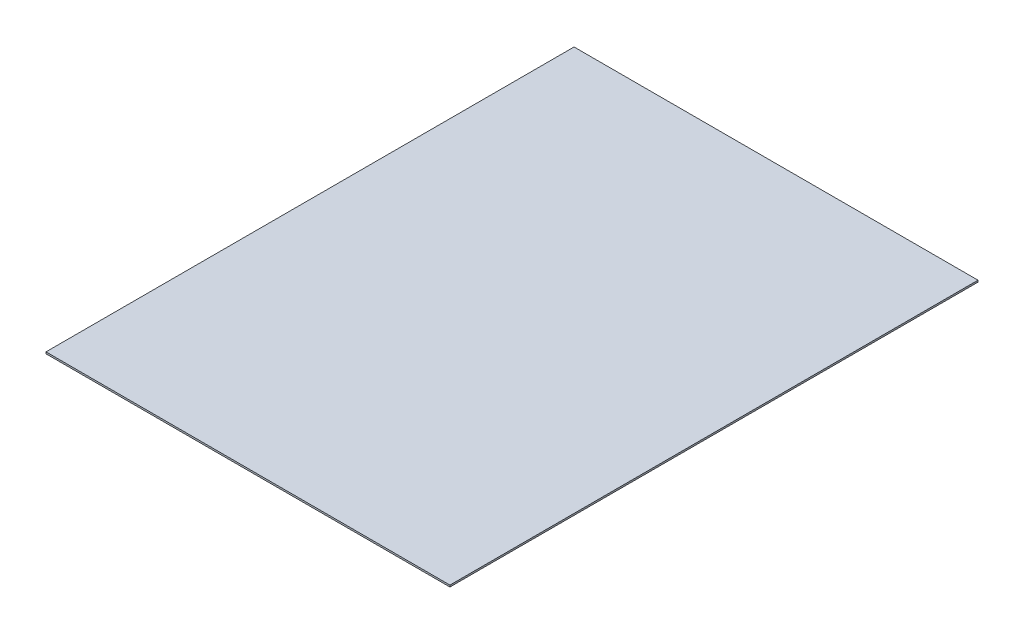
from build123d import *

# Parameters (mm, degrees)
SKIZZE1_W                       = 23527.052720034
SKIZZE1_H                       = 30756.997763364
AUFSATZ_LINEAR_AUSTRAGEN1_DEPTH = 100


with BuildPart() as part:
    # Skizze1 → Aufsatz-Linear austragen1 (new body)
    with BuildSketch(Plane(origin=(0, 0, 0), x_dir=(1, 0, 0), z_dir=(0, 1, 0))):
        with Locations((5863.254793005, 2376.582138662)):
            Rectangle(SKIZZE1_W, SKIZZE1_H)
    extrude(amount=-AUFSATZ_LINEAR_AUSTRAGEN1_DEPTH)


solid = part.part
